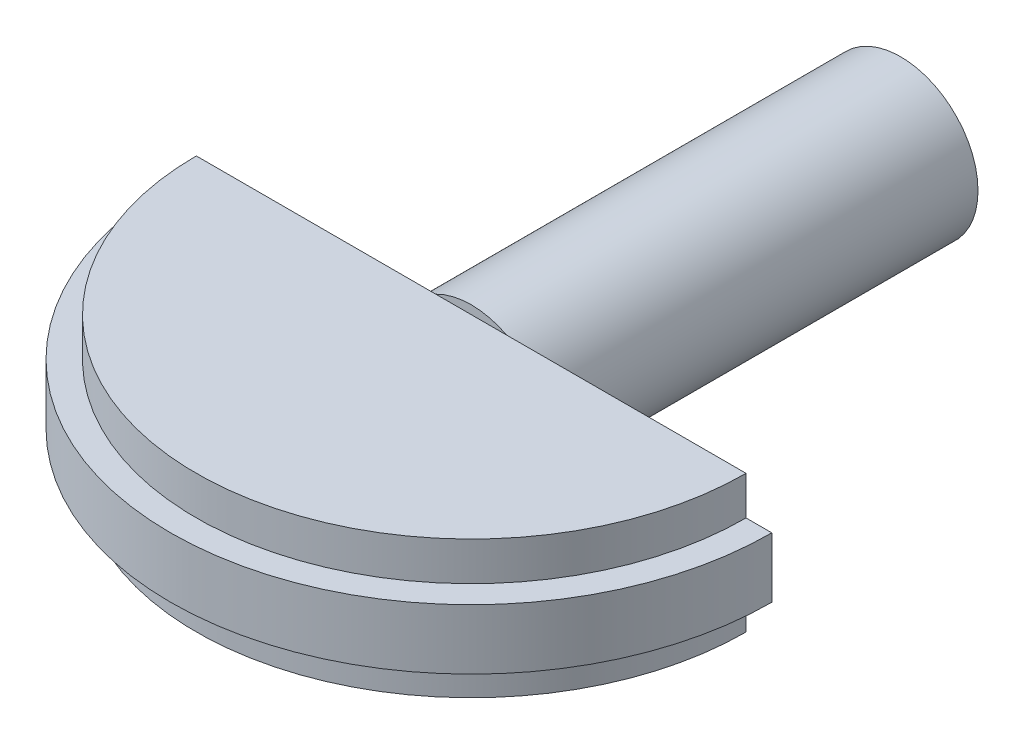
ISO-10303-21;
HEADER;
FILE_DESCRIPTION(('STEP AP214'),'2;1');
FILE_NAME('part.step','',(''),(''),'','','');
FILE_SCHEMA(('AUTOMOTIVE_DESIGN { 1 0 10303 214 1 1 1 1 }'));
ENDSEC;
DATA;
#1=APPLICATION_CONTEXT('core data for automotive mechanical design processes');
#2=APPLICATION_PROTOCOL_DEFINITION('international standard','automotive_design',2000,#1);
#3=PRODUCT_CONTEXT('',#1,'mechanical');
#4=PRODUCT('Part','Part','',(#3));
#5=PRODUCT_RELATED_PRODUCT_CATEGORY('part','',(#4));
#6=PRODUCT_DEFINITION_FORMATION('','',#4);
#7=PRODUCT_DEFINITION_CONTEXT('part definition',#1,'design');
#8=PRODUCT_DEFINITION('design','',#6,#7);
#9=PRODUCT_DEFINITION_SHAPE('','',#8);
#10=(LENGTH_UNIT() NAMED_UNIT(*) SI_UNIT(.MILLI.,.METRE.));
#11=(NAMED_UNIT(*) PLANE_ANGLE_UNIT() SI_UNIT($,.RADIAN.));
#12=(NAMED_UNIT(*) SI_UNIT($,.STERADIAN.) SOLID_ANGLE_UNIT());
#13=UNCERTAINTY_MEASURE_WITH_UNIT(LENGTH_MEASURE(1.E-05),#10,'distance_accuracy_value','');
#14=(GEOMETRIC_REPRESENTATION_CONTEXT(3) GLOBAL_UNCERTAINTY_ASSIGNED_CONTEXT((#13)) GLOBAL_UNIT_ASSIGNED_CONTEXT((#10,
#11,#12)) REPRESENTATION_CONTEXT('',''));
#15=CARTESIAN_POINT('',(0.,0.,0.));
#16=DIRECTION('',(0.,0.,1.));
#17=DIRECTION('',(1.,0.,0.));
#18=AXIS2_PLACEMENT_3D('',#15,#16,#17);
#19=CARTESIAN_POINT('',(0.,0.,50.));
#20=DIRECTION('',(0.,0.,1.));
#21=DIRECTION('',(1.,0.,0.));
#22=AXIS2_PLACEMENT_3D('',#19,#20,#21);
#23=PLANE('',#22);
#24=CARTESIAN_POINT('',(0.,0.,50.));
#25=DIRECTION('',(0.,0.,1.));
#26=DIRECTION('',(1.,0.,0.));
#27=AXIS2_PLACEMENT_3D('',#24,#25,#26);
#28=CIRCLE('',#27,9.);
#29=CARTESIAN_POINT('',(-4.12310562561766,-8.,50.));
#30=VERTEX_POINT('',#29);
#31=CARTESIAN_POINT('',(4.12310562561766,-8.,50.));
#32=VERTEX_POINT('',#31);
#33=EDGE_CURVE('E154',#30,#32,#28,.T.);
#34=ORIENTED_EDGE('',*,*,#33,.T.);
#35=DIRECTION('',(-1.,0.,0.));
#36=VECTOR('',#35,1.);
#37=CARTESIAN_POINT('',(0.,-8.,50.));
#38=LINE('',#37,#36);
#39=EDGE_CURVE('E9',#32,#30,#38,.T.);
#40=ORIENTED_EDGE('',*,*,#39,.T.);
#41=EDGE_LOOP('',(#34,#40));
#42=FACE_BOUND('',#41,.T.);
#43=ADVANCED_FACE('F14',(#42),#23,.T.);
#44=CARTESIAN_POINT('',(4.12310562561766,8.,50.));
#45=VERTEX_POINT('',#44);
#46=CARTESIAN_POINT('',(-4.12310562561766,8.,50.));
#47=VERTEX_POINT('',#46);
#48=EDGE_CURVE('E140',#45,#47,#28,.T.);
#49=ORIENTED_EDGE('',*,*,#48,.T.);
#50=DIRECTION('',(1.,0.,0.));
#51=VECTOR('',#50,1.);
#52=CARTESIAN_POINT('',(0.,8.,50.));
#53=LINE('',#52,#51);
#54=EDGE_CURVE('E22',#47,#45,#53,.T.);
#55=ORIENTED_EDGE('',*,*,#54,.T.);
#56=EDGE_LOOP('',(#49,#55));
#57=FACE_BOUND('',#56,.T.);
#58=ADVANCED_FACE('F148',(#57),#23,.T.);
#59=CARTESIAN_POINT('',(0.,0.,50.));
#60=DIRECTION('',(0.,0.,-1.));
#61=DIRECTION('',(-1.,0.,0.));
#62=AXIS2_PLACEMENT_3D('',#59,#60,#61);
#63=CYLINDRICAL_SURFACE('',#62,9.);
#64=ORIENTED_EDGE('',*,*,#48,.F.);
#65=EDGE_CURVE('E143',#32,#45,#28,.T.);
#66=ORIENTED_EDGE('',*,*,#65,.F.);
#67=ORIENTED_EDGE('',*,*,#33,.F.);
#68=EDGE_CURVE('E37',#47,#30,#28,.T.);
#69=ORIENTED_EDGE('',*,*,#68,.F.);
#70=EDGE_LOOP('',(#64,#66,#67,#69));
#71=FACE_BOUND('',#70,.T.);
#72=CARTESIAN_POINT('',(0.,0.,0.));
#73=DIRECTION('',(0.,0.,1.));
#74=DIRECTION('',(1.,0.,0.));
#75=AXIS2_PLACEMENT_3D('',#72,#73,#74);
#76=CIRCLE('',#75,9.);
#77=CARTESIAN_POINT('',(9.,0.,0.));
#78=VERTEX_POINT('',#77);
#79=EDGE_CURVE('E97',#78,#78,#76,.T.);
#80=ORIENTED_EDGE('',*,*,#79,.T.);
#81=EDGE_LOOP('',(#80));
#82=FACE_BOUND('',#81,.T.);
#83=ADVANCED_FACE('F16',(#71,#82),#63,.T.);
#84=CARTESIAN_POINT('',(0.,0.,0.));
#85=DIRECTION('',(0.,0.,1.));
#86=DIRECTION('',(1.,0.,0.));
#87=AXIS2_PLACEMENT_3D('',#84,#85,#86);
#88=PLANE('',#87);
#89=ORIENTED_EDGE('',*,*,#79,.F.);
#90=EDGE_LOOP('',(#89));
#91=FACE_BOUND('',#90,.T.);
#92=ADVANCED_FACE('F181',(#91),#88,.F.);
#93=CARTESIAN_POINT('',(0.,-8.,50.));
#94=DIRECTION('',(0.,0.,-1.));
#95=DIRECTION('',(-1.,0.,0.));
#96=AXIS2_PLACEMENT_3D('',#93,#94,#95);
#97=PLANE('',#96);
#98=ORIENTED_EDGE('',*,*,#65,.T.);
#99=DIRECTION('',(1.,0.,0.));
#100=VECTOR('',#99,1.);
#101=CARTESIAN_POINT('',(0.,8.,50.));
#102=LINE('',#101,#100);
#103=CARTESIAN_POINT('',(32.,8.,50.));
#104=VERTEX_POINT('',#103);
#105=EDGE_CURVE('E29',#45,#104,#102,.T.);
#106=ORIENTED_EDGE('',*,*,#105,.T.);
#107=DIRECTION('',(0.,1.,0.));
#108=VECTOR('',#107,1.);
#109=CARTESIAN_POINT('',(32.,8.,50.));
#110=LINE('',#109,#108);
#111=CARTESIAN_POINT('',(32.,3.5,50.));
#112=VERTEX_POINT('',#111);
#113=EDGE_CURVE('E113',#112,#104,#110,.T.);
#114=ORIENTED_EDGE('',*,*,#113,.F.);
#115=DIRECTION('',(-1.,0.,0.));
#116=VECTOR('',#115,1.);
#117=CARTESIAN_POINT('',(32.,3.5,50.));
#118=LINE('',#117,#116);
#119=CARTESIAN_POINT('',(35.,3.5,50.));
#120=VERTEX_POINT('',#119);
#121=EDGE_CURVE('E110',#120,#112,#118,.T.);
#122=ORIENTED_EDGE('',*,*,#121,.F.);
#123=DIRECTION('',(0.,1.,0.));
#124=VECTOR('',#123,1.);
#125=CARTESIAN_POINT('',(35.,3.5,50.));
#126=LINE('',#125,#124);
#127=CARTESIAN_POINT('',(35.,-3.5,50.));
#128=VERTEX_POINT('',#127);
#129=EDGE_CURVE('E105',#128,#120,#126,.T.);
#130=ORIENTED_EDGE('',*,*,#129,.F.);
#131=DIRECTION('',(1.,0.,0.));
#132=VECTOR('',#131,1.);
#133=CARTESIAN_POINT('',(32.,-3.5,50.));
#134=LINE('',#133,#132);
#135=CARTESIAN_POINT('',(32.,-3.5,50.));
#136=VERTEX_POINT('',#135);
#137=EDGE_CURVE('E103',#136,#128,#134,.T.);
#138=ORIENTED_EDGE('',*,*,#137,.F.);
#139=DIRECTION('',(0.,1.,0.));
#140=VECTOR('',#139,1.);
#141=CARTESIAN_POINT('',(32.,-3.5,50.));
#142=LINE('',#141,#140);
#143=CARTESIAN_POINT('',(32.,-8.,50.));
#144=VERTEX_POINT('',#143);
#145=EDGE_CURVE('E94',#144,#136,#142,.T.);
#146=ORIENTED_EDGE('',*,*,#145,.F.);
#147=DIRECTION('',(-1.,0.,0.));
#148=VECTOR('',#147,1.);
#149=CARTESIAN_POINT('',(0.,-8.,50.));
#150=LINE('',#149,#148);
#151=EDGE_CURVE('E80',#144,#32,#150,.T.);
#152=ORIENTED_EDGE('',*,*,#151,.T.);
#153=EDGE_LOOP('',(#98,#106,#114,#122,#130,#138,#146,#152));
#154=FACE_BOUND('',#153,.T.);
#155=ADVANCED_FACE('F100',(#154),#97,.T.);
#156=ORIENTED_EDGE('',*,*,#68,.T.);
#157=CARTESIAN_POINT('',(-32.,-8.,50.));
#158=VERTEX_POINT('',#157);
#159=EDGE_CURVE('E89',#30,#158,#150,.T.);
#160=ORIENTED_EDGE('',*,*,#159,.T.);
#161=DIRECTION('',(0.,1.,0.));
#162=VECTOR('',#161,1.);
#163=CARTESIAN_POINT('',(-32.,-3.5,50.));
#164=LINE('',#163,#162);
#165=CARTESIAN_POINT('',(-32.,-3.5,50.));
#166=VERTEX_POINT('',#165);
#167=EDGE_CURVE('E88',#158,#166,#164,.T.);
#168=ORIENTED_EDGE('',*,*,#167,.T.);
#169=DIRECTION('',(-1.,0.,0.));
#170=VECTOR('',#169,1.);
#171=CARTESIAN_POINT('',(-32.,-3.5,50.));
#172=LINE('',#171,#170);
#173=CARTESIAN_POINT('',(-35.,-3.5,50.));
#174=VERTEX_POINT('',#173);
#175=EDGE_CURVE('E117',#166,#174,#172,.T.);
#176=ORIENTED_EDGE('',*,*,#175,.T.);
#177=DIRECTION('',(0.,1.,0.));
#178=VECTOR('',#177,1.);
#179=CARTESIAN_POINT('',(-35.,3.5,50.));
#180=LINE('',#179,#178);
#181=CARTESIAN_POINT('',(-35.,3.5,50.));
#182=VERTEX_POINT('',#181);
#183=EDGE_CURVE('E120',#174,#182,#180,.T.);
#184=ORIENTED_EDGE('',*,*,#183,.T.);
#185=DIRECTION('',(1.,0.,0.));
#186=VECTOR('',#185,1.);
#187=CARTESIAN_POINT('',(-32.,3.5,50.));
#188=LINE('',#187,#186);
#189=CARTESIAN_POINT('',(-32.,3.5,50.));
#190=VERTEX_POINT('',#189);
#191=EDGE_CURVE('E123',#182,#190,#188,.T.);
#192=ORIENTED_EDGE('',*,*,#191,.T.);
#193=DIRECTION('',(0.,1.,0.));
#194=VECTOR('',#193,1.);
#195=CARTESIAN_POINT('',(-32.,8.,50.));
#196=LINE('',#195,#194);
#197=CARTESIAN_POINT('',(-32.,8.,50.));
#198=VERTEX_POINT('',#197);
#199=EDGE_CURVE('E126',#190,#198,#196,.T.);
#200=ORIENTED_EDGE('',*,*,#199,.T.);
#201=EDGE_CURVE('E129',#198,#47,#102,.T.);
#202=ORIENTED_EDGE('',*,*,#201,.T.);
#203=EDGE_LOOP('',(#156,#160,#168,#176,#184,#192,#200,#202));
#204=FACE_BOUND('',#203,.T.);
#205=ADVANCED_FACE('F171',(#204),#97,.T.);
#206=CARTESIAN_POINT('',(0.,-8.,50.));
#207=DIRECTION('',(0.,1.,0.));
#208=DIRECTION('',(0.,0.,1.));
#209=AXIS2_PLACEMENT_3D('',#206,#207,#208);
#210=PLANE('',#209);
#211=CARTESIAN_POINT('',(0.,-8.,50.));
#212=DIRECTION('',(0.,1.,0.));
#213=DIRECTION('',(0.,0.,1.));
#214=AXIS2_PLACEMENT_3D('',#211,#212,#213);
#215=CIRCLE('',#214,32.);
#216=EDGE_CURVE('E83',#158,#144,#215,.T.);
#217=ORIENTED_EDGE('',*,*,#216,.F.);
#218=ORIENTED_EDGE('',*,*,#159,.F.);
#219=ORIENTED_EDGE('',*,*,#39,.F.);
#220=ORIENTED_EDGE('',*,*,#151,.F.);
#221=EDGE_LOOP('',(#217,#218,#219,#220));
#222=FACE_BOUND('',#221,.T.);
#223=ADVANCED_FACE('F82',(#222),#210,.F.);
#224=CARTESIAN_POINT('',(0.,12.2374042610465,50.));
#225=DIRECTION('',(0.,1.,0.));
#226=DIRECTION('',(0.,0.,1.));
#227=AXIS2_PLACEMENT_3D('',#224,#225,#226);
#228=CYLINDRICAL_SURFACE('',#227,32.);
#229=CARTESIAN_POINT('',(0.,-3.5,50.));
#230=DIRECTION('',(0.,1.,0.));
#231=DIRECTION('',(0.,0.,1.));
#232=AXIS2_PLACEMENT_3D('',#229,#230,#231);
#233=CIRCLE('',#232,32.);
#234=EDGE_CURVE('E98',#166,#136,#233,.T.);
#235=ORIENTED_EDGE('',*,*,#234,.F.);
#236=ORIENTED_EDGE('',*,*,#167,.F.);
#237=ORIENTED_EDGE('',*,*,#216,.T.);
#238=ORIENTED_EDGE('',*,*,#145,.T.);
#239=EDGE_LOOP('',(#235,#236,#237,#238));
#240=FACE_BOUND('',#239,.T.);
#241=ADVANCED_FACE('F93',(#240),#228,.T.);
#242=CARTESIAN_POINT('',(-32.,-3.5,50.));
#243=DIRECTION('',(0.,1.,0.));
#244=DIRECTION('',(0.,0.,1.));
#245=AXIS2_PLACEMENT_3D('',#242,#243,#244);
#246=PLANE('',#245);
#247=CARTESIAN_POINT('',(0.,-3.5,50.));
#248=DIRECTION('',(0.,1.,0.));
#249=DIRECTION('',(0.,0.,1.));
#250=AXIS2_PLACEMENT_3D('',#247,#248,#249);
#251=CIRCLE('',#250,35.);
#252=EDGE_CURVE('E137',#174,#128,#251,.T.);
#253=ORIENTED_EDGE('',*,*,#252,.F.);
#254=ORIENTED_EDGE('',*,*,#175,.F.);
#255=ORIENTED_EDGE('',*,*,#234,.T.);
#256=ORIENTED_EDGE('',*,*,#137,.T.);
#257=EDGE_LOOP('',(#253,#254,#255,#256));
#258=FACE_BOUND('',#257,.T.);
#259=ADVANCED_FACE('F170',(#258),#246,.F.);
#260=CARTESIAN_POINT('',(0.,12.2374042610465,50.));
#261=DIRECTION('',(0.,1.,0.));
#262=DIRECTION('',(0.,0.,1.));
#263=AXIS2_PLACEMENT_3D('',#260,#261,#262);
#264=CYLINDRICAL_SURFACE('',#263,35.);
#265=CARTESIAN_POINT('',(0.,3.5,50.));
#266=DIRECTION('',(0.,1.,0.));
#267=DIRECTION('',(0.,0.,1.));
#268=AXIS2_PLACEMENT_3D('',#265,#266,#267);
#269=CIRCLE('',#268,35.);
#270=EDGE_CURVE('E135',#182,#120,#269,.T.);
#271=ORIENTED_EDGE('',*,*,#270,.F.);
#272=ORIENTED_EDGE('',*,*,#183,.F.);
#273=ORIENTED_EDGE('',*,*,#252,.T.);
#274=ORIENTED_EDGE('',*,*,#129,.T.);
#275=EDGE_LOOP('',(#271,#272,#273,#274));
#276=FACE_BOUND('',#275,.T.);
#277=ADVANCED_FACE('F166',(#276),#264,.T.);
#278=CARTESIAN_POINT('',(-32.,3.5,50.));
#279=DIRECTION('',(0.,-1.,0.));
#280=DIRECTION('',(0.,0.,-1.));
#281=AXIS2_PLACEMENT_3D('',#278,#279,#280);
#282=PLANE('',#281);
#283=CARTESIAN_POINT('',(0.,3.5,50.));
#284=DIRECTION('',(0.,1.,0.));
#285=DIRECTION('',(0.,0.,1.));
#286=AXIS2_PLACEMENT_3D('',#283,#284,#285);
#287=CIRCLE('',#286,32.);
#288=EDGE_CURVE('E133',#190,#112,#287,.T.);
#289=ORIENTED_EDGE('',*,*,#288,.F.);
#290=ORIENTED_EDGE('',*,*,#191,.F.);
#291=ORIENTED_EDGE('',*,*,#270,.T.);
#292=ORIENTED_EDGE('',*,*,#121,.T.);
#293=EDGE_LOOP('',(#289,#290,#291,#292));
#294=FACE_BOUND('',#293,.T.);
#295=ADVANCED_FACE('F164',(#294),#282,.F.);
#296=CARTESIAN_POINT('',(0.,12.2374042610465,50.));
#297=DIRECTION('',(0.,1.,0.));
#298=DIRECTION('',(0.,0.,1.));
#299=AXIS2_PLACEMENT_3D('',#296,#297,#298);
#300=CYLINDRICAL_SURFACE('',#299,32.);
#301=CARTESIAN_POINT('',(0.,8.,50.));
#302=DIRECTION('',(0.,1.,0.));
#303=DIRECTION('',(0.,0.,1.));
#304=AXIS2_PLACEMENT_3D('',#301,#302,#303);
#305=CIRCLE('',#304,32.);
#306=EDGE_CURVE('E131',#198,#104,#305,.T.);
#307=ORIENTED_EDGE('',*,*,#306,.F.);
#308=ORIENTED_EDGE('',*,*,#199,.F.);
#309=ORIENTED_EDGE('',*,*,#288,.T.);
#310=ORIENTED_EDGE('',*,*,#113,.T.);
#311=EDGE_LOOP('',(#307,#308,#309,#310));
#312=FACE_BOUND('',#311,.T.);
#313=ADVANCED_FACE('F161',(#312),#300,.T.);
#314=CARTESIAN_POINT('',(0.,8.,50.));
#315=DIRECTION('',(0.,-1.,0.));
#316=DIRECTION('',(0.,0.,-1.));
#317=AXIS2_PLACEMENT_3D('',#314,#315,#316);
#318=PLANE('',#317);
#319=ORIENTED_EDGE('',*,*,#201,.F.);
#320=ORIENTED_EDGE('',*,*,#306,.T.);
#321=ORIENTED_EDGE('',*,*,#105,.F.);
#322=ORIENTED_EDGE('',*,*,#54,.F.);
#323=EDGE_LOOP('',(#319,#320,#321,#322));
#324=FACE_BOUND('',#323,.T.);
#325=ADVANCED_FACE('F158',(#324),#318,.F.);
#326=CLOSED_SHELL('',(#43,#58,#83,#92,#155,#205,#223,#241,#259,#277,#295,#313,#325));
#327=MANIFOLD_SOLID_BREP('B1',#326);
#328=ADVANCED_BREP_SHAPE_REPRESENTATION('',(#18,#327),#14);
#329=SHAPE_DEFINITION_REPRESENTATION(#9,#328);
ENDSEC;
END-ISO-10303-21;
